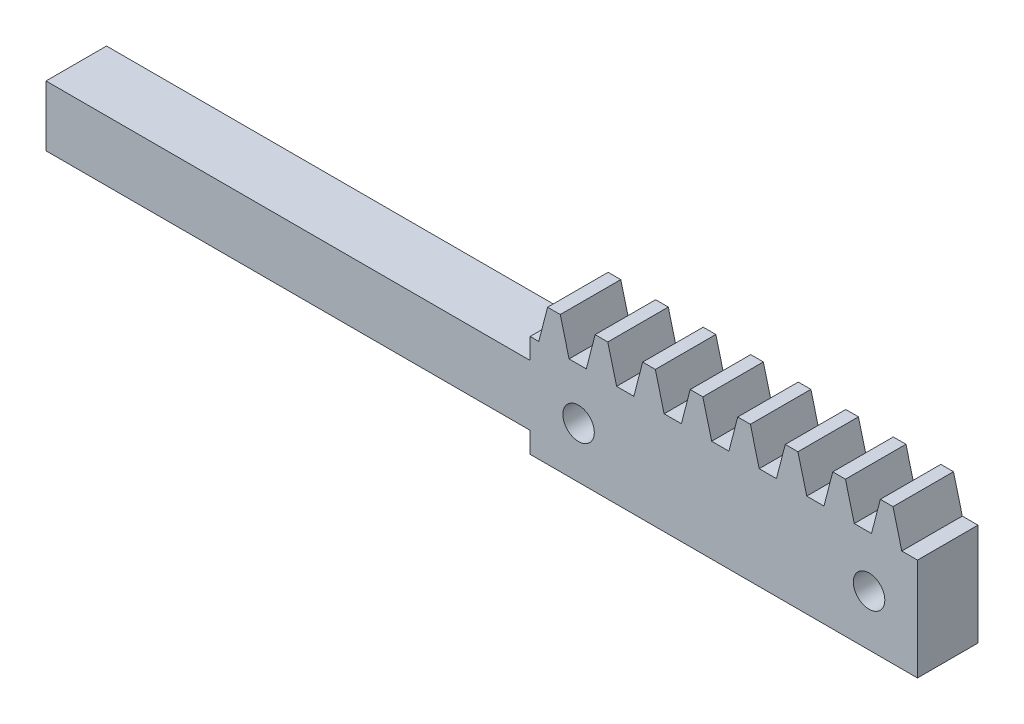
from build123d import *

# Parameters (mm, degrees)
BLANKSKE_W          = 40.64
BLANKSKE_H          = 14.2875
BLANK_DEPTH         = 6.35
TOOTHCUTSIM_DEPTH   = 44.543825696
TEETHCUTS_COUNT     = 9
TEETHCUTS_PITCH     = 4.987278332
SKETCH1_R           = 1.651
CUT_EXTRUDE1_DEPTH  = 9.398
SKETCH2_W           = 50.8
SKETCH2_H           = 6.35
BOSS_EXTRUDE1_DEPTH = 6.35
SCALE1_SCALE        = 0.5


with BuildPart() as part:
    # BlankSke → Blank (new body)
    with BuildSketch(Plane.XY):
        with Locations((20.32, 7.14375)):
            Rectangle(BLANKSKE_W, BLANKSKE_H)
    extrude(amount=-BLANK_DEPTH)

    # TooCutSkeSim → ToothCutSim (cut, through all)
    with BuildSketch(Plane.XY):
        Polygon((0.905075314, 10.715625), (-0.905075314, 10.715625), (-1.835393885, 14.3129), (1.835393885, 14.3129), align=None)
    toothcutsim = extrude(amount=-TOOTHCUTSIM_DEPTH, mode=Mode.SUBTRACT)

    # TeethCuts: ToothCutSim ×9
    with Locations(*[(i * TEETHCUTS_PITCH, 0, 0) for i in range(1, TEETHCUTS_COUNT)]):
        add(toothcutsim, mode=Mode.SUBTRACT)

    # Sketch1 → Cut-Extrude1 (cut)
    with BuildSketch(Plane.XY):
        with Locations((5.08, 5.3578125)):
            Circle(SKETCH1_R)
        with Locations((35.56, 5.3578125)):
            Circle(SKETCH1_R)
    extrude(amount=-CUT_EXTRUDE1_DEPTH, mode=Mode.SUBTRACT)

    # Sketch2 → Boss-Extrude1 (add)
    with BuildSketch(Plane.XY):
        with Locations((-25.4, 5.3578125)):
            Rectangle(SKETCH2_W, SKETCH2_H)
    extrude(amount=-BOSS_EXTRUDE1_DEPTH)


with BuildPart() as part_1:
    # Scale1: scaled about (1.976833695, 5.909481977, -3.175)
    add(part.part.scale(SCALE1_SCALE).moved(Location((0.988416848, 2.954740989, -1.5875))))


solid = part_1.part
